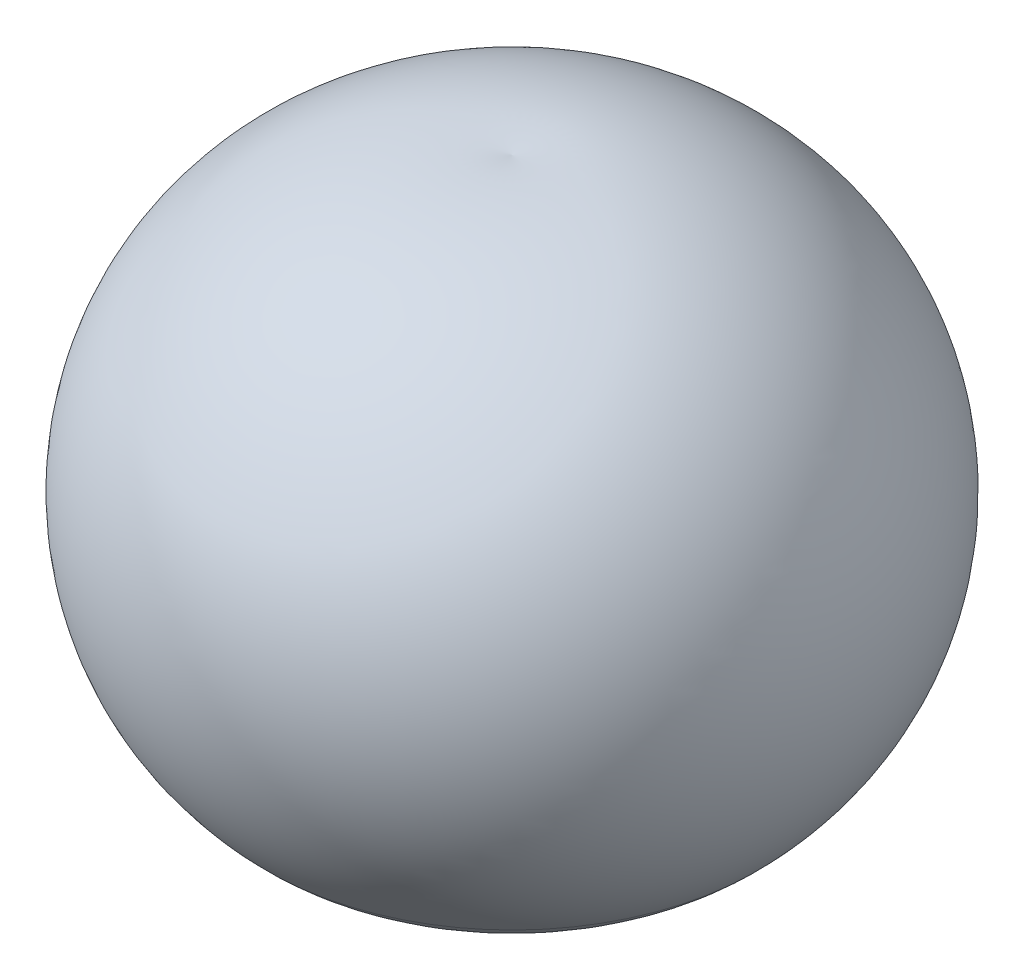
ISO-10303-21;
HEADER;
FILE_DESCRIPTION(('STEP AP214'),'2;1');
FILE_NAME('part.step','',(''),(''),'','','');
FILE_SCHEMA(('AUTOMOTIVE_DESIGN { 1 0 10303 214 1 1 1 1 }'));
ENDSEC;
DATA;
#1=APPLICATION_CONTEXT('core data for automotive mechanical design processes');
#2=APPLICATION_PROTOCOL_DEFINITION('international standard','automotive_design',2000,#1);
#3=PRODUCT_CONTEXT('',#1,'mechanical');
#4=PRODUCT('Part','Part','',(#3));
#5=PRODUCT_RELATED_PRODUCT_CATEGORY('part','',(#4));
#6=PRODUCT_DEFINITION_FORMATION('','',#4);
#7=PRODUCT_DEFINITION_CONTEXT('part definition',#1,'design');
#8=PRODUCT_DEFINITION('design','',#6,#7);
#9=PRODUCT_DEFINITION_SHAPE('','',#8);
#10=(LENGTH_UNIT() NAMED_UNIT(*) SI_UNIT(.MILLI.,.METRE.));
#11=(NAMED_UNIT(*) PLANE_ANGLE_UNIT() SI_UNIT($,.RADIAN.));
#12=(NAMED_UNIT(*) SI_UNIT($,.STERADIAN.) SOLID_ANGLE_UNIT());
#13=UNCERTAINTY_MEASURE_WITH_UNIT(LENGTH_MEASURE(1.E-05),#10,'distance_accuracy_value','');
#14=(GEOMETRIC_REPRESENTATION_CONTEXT(3) GLOBAL_UNCERTAINTY_ASSIGNED_CONTEXT((#13)) GLOBAL_UNIT_ASSIGNED_CONTEXT((#10,
#11,#12)) REPRESENTATION_CONTEXT('',''));
#15=CARTESIAN_POINT('',(0.,0.,0.));
#16=DIRECTION('',(0.,0.,1.));
#17=DIRECTION('',(1.,0.,0.));
#18=AXIS2_PLACEMENT_3D('',#15,#16,#17);
#19=CARTESIAN_POINT('',(0.,550.,-230.));
#20=DIRECTION('',(-1.,0.,0.));
#21=DIRECTION('',(0.,0.,-1.));
#22=AXIS2_PLACEMENT_3D('',#19,#20,#21);
#23=CIRCLE('',#22,1880.12426434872);
#24=TRIMMED_CURVE('',#23,(PARAMETER_VALUE(-1.69343586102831)),
(PARAMETER_VALUE(1.69343586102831)),.T.,.PARAMETER.);
#25=CARTESIAN_POINT('',(0.,550.,0.));
#26=DIRECTION('',(0.,-1.,0.));
#27=AXIS1_PLACEMENT('',#25,#26);
#28=SURFACE_OF_REVOLUTION('',#24,#27);
#29=CARTESIAN_POINT('',(0.,-779.448616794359,0.));
#30=DIRECTION('',(0.,-1.,0.));
#31=DIRECTION('',(0.,0.,-1.));
#32=AXIS2_PLACEMENT_3D('',#29,#30,#31);
#33=CIRCLE('',#32,1559.44861679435);
#34=CARTESIAN_POINT('',(0.,-779.448616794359,-1559.44861679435));
#35=VERTEX_POINT('',#34);
#36=EDGE_CURVE('E11',#35,#35,#33,.T.);
#37=ORIENTED_EDGE('',*,*,#36,.F.);
#38=EDGE_LOOP('',(#37));
#39=FACE_BOUND('',#38,.T.);
#40=CARTESIAN_POINT('',(0.,2416.00301430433,1.11022302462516E-13));
#41=VERTEX_POINT('',#40);
#42=VERTEX_LOOP('',#41);
#43=FACE_BOUND('',#42,.T.);
#44=ADVANCED_FACE('F35',(#39,#43),#28,.T.);
#45=CARTESIAN_POINT('',(0.,-51.0407640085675,-831.040764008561));
#46=DIRECTION('',(-1.,0.,0.));
#47=DIRECTION('',(0.,0.,-1.));
#48=AXIS2_PLACEMENT_3D('',#45,#46,#47);
#49=CIRCLE('',#48,1030.12426434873);
#50=TRIMMED_CURVE('',#49,(PARAMETER_VALUE(-2.50940776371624)),
(PARAMETER_VALUE(2.50940776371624)),.T.,.PARAMETER.);
#51=CARTESIAN_POINT('',(0.,-51.0407640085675,0.));
#52=DIRECTION('',(0.,-1.,0.));
#53=AXIS1_PLACEMENT('',#51,#52);
#54=SURFACE_OF_REVOLUTION('',#50,#53);
#55=CARTESIAN_POINT('',(0.,-659.750258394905,0.));
#56=VERTEX_POINT('',#55);
#57=VERTEX_LOOP('',#56);
#58=FACE_BOUND('',#57,.T.);
#59=ORIENTED_EDGE('',*,*,#36,.T.);
#60=EDGE_LOOP('',(#59));
#61=FACE_BOUND('',#60,.T.);
#62=ADVANCED_FACE('F69',(#58,#61),#54,.T.);
#63=CLOSED_SHELL('',(#44,#62));
#64=CARTESIAN_POINT('',(0.,550.,620.));
#65=DIRECTION('',(-1.,0.,0.));
#66=DIRECTION('',(0.,0.,-1.));
#67=AXIS2_PLACEMENT_3D('',#64,#65,#66);
#68=CIRCLE('',#67,1030.12426434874);
#69=TRIMMED_CURVE('',#68,(PARAMETER_VALUE(-0.924956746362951)),
(PARAMETER_VALUE(0.924956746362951)),.T.,.PARAMETER.);
#70=CARTESIAN_POINT('',(0.,550.,0.));
#71=DIRECTION('',(0.,-1.,0.));
#72=AXIS1_PLACEMENT('',#70,#71);
#73=SURFACE_OF_REVOLUTION('',#69,#72);
#74=CARTESIAN_POINT('',(0.,1372.65180969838,0.));
#75=VERTEX_POINT('',#74);
#76=VERTEX_LOOP('',#75);
#77=FACE_BOUND('',#76,.T.);
#78=CARTESIAN_POINT('',(0.,893.843866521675,0.));
#79=DIRECTION('',(0.,-1.,0.));
#80=DIRECTION('',(0.,0.,-1.));
#81=AXIS2_PLACEMENT_3D('',#78,#79,#80);
#82=CIRCLE('',#81,351.044486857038);
#83=CARTESIAN_POINT('',(0.,893.843866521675,-351.044486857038));
#84=VERTEX_POINT('',#83);
#85=EDGE_CURVE('E44',#84,#84,#82,.T.);
#86=ORIENTED_EDGE('',*,*,#85,.T.);
#87=EDGE_LOOP('',(#86));
#88=FACE_BOUND('',#87,.T.);
#89=ADVANCED_FACE('F37',(#77,#88),#73,.F.);
#90=CARTESIAN_POINT('',(0.,550.,-230.));
#91=DIRECTION('',(-1.,0.,0.));
#92=DIRECTION('',(0.,0.,-1.));
#93=AXIS2_PLACEMENT_3D('',#90,#91,#92);
#94=CIRCLE('',#93,364.527601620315);
#95=TRIMMED_CURVE('',#94,(PARAMETER_VALUE(-2.25357806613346)),
(PARAMETER_VALUE(2.25357806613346)),.T.,.PARAMETER.);
#96=CARTESIAN_POINT('',(0.,550.,0.));
#97=DIRECTION('',(0.,-1.,0.));
#98=AXIS1_PLACEMENT('',#96,#97);
#99=SURFACE_OF_REVOLUTION('',#95,#98);
#100=ORIENTED_EDGE('',*,*,#85,.F.);
#101=EDGE_LOOP('',(#100));
#102=FACE_BOUND('',#101,.T.);
#103=CARTESIAN_POINT('',(0.,267.191986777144,0.));
#104=VERTEX_POINT('',#103);
#105=VERTEX_LOOP('',#104);
#106=FACE_BOUND('',#105,.T.);
#107=ADVANCED_FACE('F59',(#102,#106),#99,.F.);
#108=CLOSED_SHELL('',(#89,#107));
#109=ORIENTED_CLOSED_SHELL('',*,#108,.T.);
#110=BREP_WITH_VOIDS('B2',#63,(#109));
#111=ADVANCED_BREP_SHAPE_REPRESENTATION('',(#18,#110),#14);
#112=SHAPE_DEFINITION_REPRESENTATION(#9,#111);
ENDSEC;
END-ISO-10303-21;
